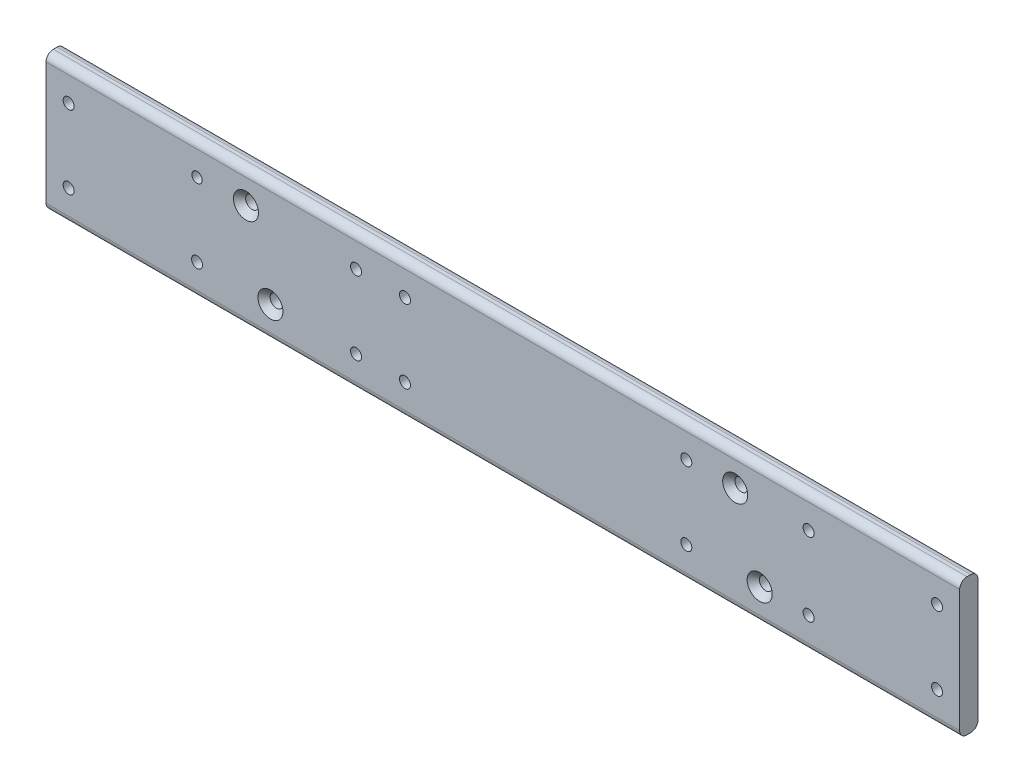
from build123d import *

# Parameters (mm, degrees)
ESQUISSE1_W          = 747
ESQUISSE1_H          = 112
ESQUISSE1_R          = 4.25
ESQUISSE1_R_2        = 4.5
ESQUISSE1_R_3        = 5.25
BASE_EXTRUSION_DEPTH = 15
CONG_1_R             = 6
CHANFREIN1_SIZE      = 5


with BuildPart() as part:
    # Esquisse1 → Base-Extrusion (new body)
    with BuildSketch(Plane.XY):
        with Locations((1125.5, 56)):
            Rectangle(ESQUISSE1_W, ESQUISSE1_H)
        with Locations((875.5, 86)):
            Circle(ESQUISSE1_R, mode=Mode.SUBTRACT)
        with Locations((1045.5, 86)):
            Circle(ESQUISSE1_R_2, mode=Mode.SUBTRACT)
        with Locations((1005.5, 86)):
            Circle(ESQUISSE1_R_2, mode=Mode.SUBTRACT)
        with Locations((1275.5, 86)):
            Circle(ESQUISSE1_R_2, mode=Mode.SUBTRACT)
        with Locations((770.5, 86)):
            Circle(ESQUISSE1_R_2, mode=Mode.SUBTRACT)
        with Locations((770.5, 26)):
            Circle(ESQUISSE1_R_2, mode=Mode.SUBTRACT)
        with Locations((1480.5, 86)):
            Circle(ESQUISSE1_R_2, mode=Mode.SUBTRACT)
        with Locations((1480.5, 26)):
            Circle(ESQUISSE1_R_2, mode=Mode.SUBTRACT)
        with Locations((1005.5, 26)):
            Circle(ESQUISSE1_R_2, mode=Mode.SUBTRACT)
        with Locations((1275.5, 26)):
            Circle(ESQUISSE1_R_2, mode=Mode.SUBTRACT)
        with Locations((1375.5, 86)):
            Circle(ESQUISSE1_R_2, mode=Mode.SUBTRACT)
        with Locations((1375.5, 26)):
            Circle(ESQUISSE1_R_2, mode=Mode.SUBTRACT)
        with Locations((1045.5, 26)):
            Circle(ESQUISSE1_R_2, mode=Mode.SUBTRACT)
        with Locations((915.5, 86)):
            Circle(ESQUISSE1_R_3, mode=Mode.SUBTRACT)
        with Locations((875.5, 26)):
            Circle(ESQUISSE1_R_2, mode=Mode.SUBTRACT)
        with Locations((935.5, 26)):
            Circle(ESQUISSE1_R_3, mode=Mode.SUBTRACT)
        with Locations((1315.5, 86)):
            Circle(ESQUISSE1_R_3, mode=Mode.SUBTRACT)
        with Locations((1335.5, 26)):
            Circle(ESQUISSE1_R_3, mode=Mode.SUBTRACT)
    extrude(amount=BASE_EXTRUSION_DEPTH)

    # Cong_1
    cong_1_edges = [part.edges().sort_by_distance(p)[0] for p in [
        (1125.5, 112, 0),
        (1125.5, 112, 15),
        (1125.5, 0, 0),
        (1125.5, 0, 15),
    ]]
    fillet(cong_1_edges, radius=CONG_1_R)

    # Chanfrein1
    chanfrein1_edges = [part.edges().sort_by_distance(p)[0] for p in [
        (910.25, 86, 15),
        (930.25, 26, 15),
        (1310.25, 86, 15),
        (1330.25, 26, 15),
    ]]
    chamfer(chanfrein1_edges, length=CHANFREIN1_SIZE)


solid = part.part
